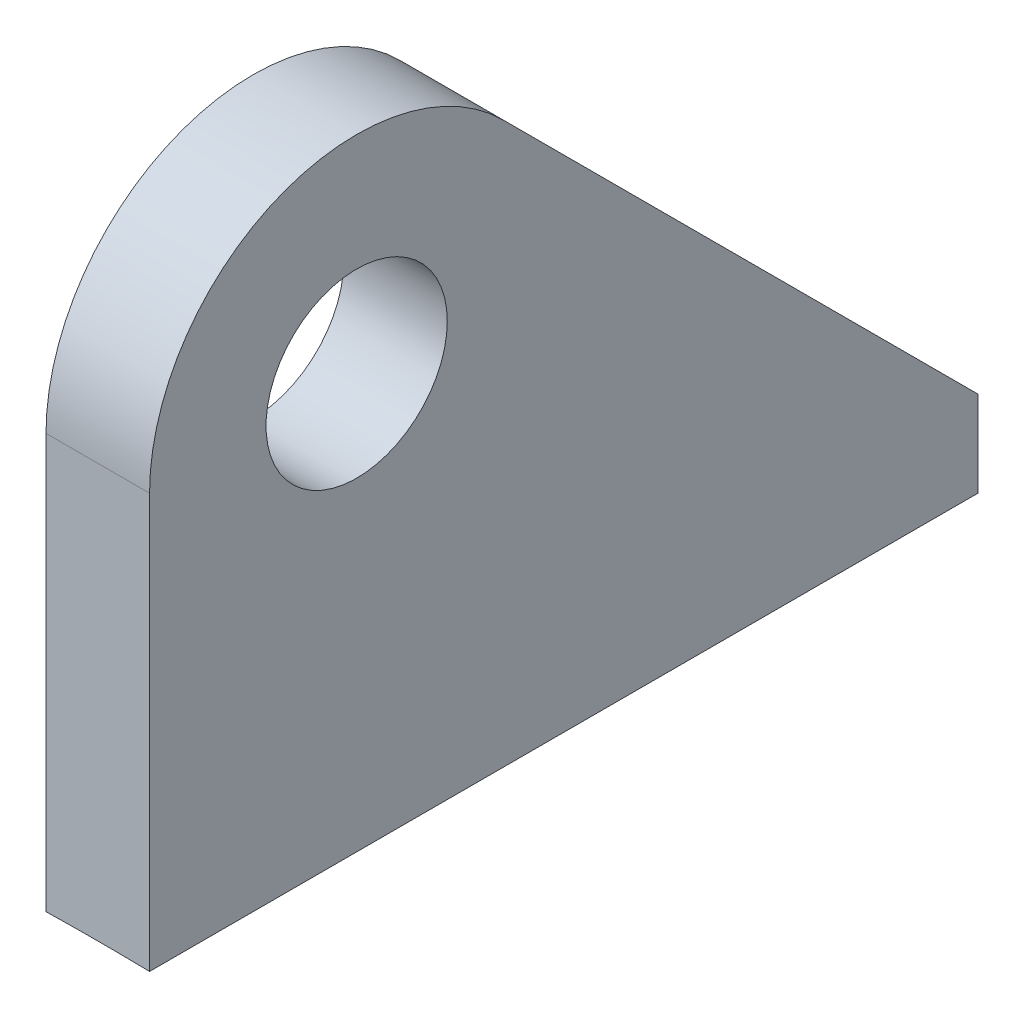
ISO-10303-21;
HEADER;
FILE_DESCRIPTION(('STEP AP214'),'2;1');
FILE_NAME('part.step','',(''),(''),'','','');
FILE_SCHEMA(('AUTOMOTIVE_DESIGN { 1 0 10303 214 1 1 1 1 }'));
ENDSEC;
DATA;
#1=APPLICATION_CONTEXT('core data for automotive mechanical design processes');
#2=APPLICATION_PROTOCOL_DEFINITION('international standard','automotive_design',2000,#1);
#3=PRODUCT_CONTEXT('',#1,'mechanical');
#4=PRODUCT('Part','Part','',(#3));
#5=PRODUCT_RELATED_PRODUCT_CATEGORY('part','',(#4));
#6=PRODUCT_DEFINITION_FORMATION('','',#4);
#7=PRODUCT_DEFINITION_CONTEXT('part definition',#1,'design');
#8=PRODUCT_DEFINITION('design','',#6,#7);
#9=PRODUCT_DEFINITION_SHAPE('','',#8);
#10=(LENGTH_UNIT() NAMED_UNIT(*) SI_UNIT(.MILLI.,.METRE.));
#11=(NAMED_UNIT(*) PLANE_ANGLE_UNIT() SI_UNIT($,.RADIAN.));
#12=(NAMED_UNIT(*) SI_UNIT($,.STERADIAN.) SOLID_ANGLE_UNIT());
#13=UNCERTAINTY_MEASURE_WITH_UNIT(LENGTH_MEASURE(1.E-05),#10,'distance_accuracy_value','');
#14=(GEOMETRIC_REPRESENTATION_CONTEXT(3) GLOBAL_UNCERTAINTY_ASSIGNED_CONTEXT((#13)) GLOBAL_UNIT_ASSIGNED_CONTEXT((#10,
#11,#12)) REPRESENTATION_CONTEXT('',''));
#15=CARTESIAN_POINT('',(0.,0.,0.));
#16=DIRECTION('',(0.,0.,1.));
#17=DIRECTION('',(1.,0.,0.));
#18=AXIS2_PLACEMENT_3D('',#15,#16,#17);
#19=CARTESIAN_POINT('',(12.7,101.6,-50.8));
#20=DIRECTION('',(-1.,0.,0.));
#21=DIRECTION('',(0.,0.,1.));
#22=AXIS2_PLACEMENT_3D('',#19,#20,#21);
#23=PLANE('',#22);
#24=CARTESIAN_POINT('',(12.7,101.6,-50.8));
#25=DIRECTION('',(1.,0.,0.));
#26=DIRECTION('',(0.,0.,1.));
#27=AXIS2_PLACEMENT_3D('',#24,#25,#26);
#28=CIRCLE('',#27,50.8);
#29=CARTESIAN_POINT('',(12.7,137.521024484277,-86.7210244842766));
#30=VERTEX_POINT('',#29);
#31=CARTESIAN_POINT('',(12.7,101.6,0.));
#32=VERTEX_POINT('',#31);
#33=EDGE_CURVE('E118',#30,#32,#28,.T.);
#34=ORIENTED_EDGE('',*,*,#33,.T.);
#35=DIRECTION('',(0.,-1.,0.));
#36=VECTOR('',#35,1.);
#37=CARTESIAN_POINT('',(12.7,101.6,0.));
#38=LINE('',#37,#36);
#39=CARTESIAN_POINT('',(12.7000000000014,0.,0.));
#40=VERTEX_POINT('',#39);
#41=EDGE_CURVE('E79',#32,#40,#38,.T.);
#42=ORIENTED_EDGE('',*,*,#41,.T.);
#43=DIRECTION('',(0.,0.,-1.));
#44=VECTOR('',#43,1.);
#45=CARTESIAN_POINT('',(12.7,0.,0.));
#46=LINE('',#45,#44);
#47=CARTESIAN_POINT('',(12.7000000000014,0.,-203.2));
#48=VERTEX_POINT('',#47);
#49=EDGE_CURVE('E92',#40,#48,#46,.T.);
#50=ORIENTED_EDGE('',*,*,#49,.T.);
#51=DIRECTION('',(0.,1.,0.));
#52=VECTOR('',#51,1.);
#53=CARTESIAN_POINT('',(12.7,0.,-203.2));
#54=LINE('',#53,#52);
#55=CARTESIAN_POINT('',(12.7,21.0420489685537,-203.2));
#56=VERTEX_POINT('',#55);
#57=EDGE_CURVE('E100',#48,#56,#54,.T.);
#58=ORIENTED_EDGE('',*,*,#57,.T.);
#59=DIRECTION('',(0.,0.707106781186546,0.707106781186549));
#60=VECTOR('',#59,1.);
#61=CARTESIAN_POINT('',(12.7,21.0420489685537,-203.2));
#62=LINE('',#61,#60);
#63=EDGE_CURVE('E50',#56,#30,#62,.T.);
#64=ORIENTED_EDGE('',*,*,#63,.T.);
#65=EDGE_LOOP('',(#34,#42,#50,#58,#64));
#66=FACE_BOUND('',#65,.T.);
#67=CARTESIAN_POINT('',(12.7,101.6,-50.8));
#68=DIRECTION('',(1.,0.,0.));
#69=DIRECTION('',(0.,0.,-1.));
#70=AXIS2_PLACEMENT_3D('',#67,#68,#69);
#71=CIRCLE('',#70,22.225);
#72=CARTESIAN_POINT('',(12.7,101.6,-73.025));
#73=VERTEX_POINT('',#72);
#74=EDGE_CURVE('E112',#73,#73,#71,.T.);
#75=ORIENTED_EDGE('',*,*,#74,.F.);
#76=EDGE_LOOP('',(#75));
#77=FACE_BOUND('',#76,.T.);
#78=ADVANCED_FACE('F33',(#66,#77),#23,.F.);
#79=CARTESIAN_POINT('',(-12.7,101.6,-50.8));
#80=DIRECTION('',(-1.,0.,0.));
#81=DIRECTION('',(0.,0.,1.));
#82=AXIS2_PLACEMENT_3D('',#79,#80,#81);
#83=PLANE('',#82);
#84=CARTESIAN_POINT('',(-12.7,101.6,-50.8));
#85=DIRECTION('',(1.,0.,0.));
#86=DIRECTION('',(0.,0.,1.));
#87=AXIS2_PLACEMENT_3D('',#84,#85,#86);
#88=CIRCLE('',#87,50.8);
#89=CARTESIAN_POINT('',(-12.7,137.521024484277,-86.7210244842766));
#90=VERTEX_POINT('',#89);
#91=CARTESIAN_POINT('',(-12.7,101.6,0.));
#92=VERTEX_POINT('',#91);
#93=EDGE_CURVE('E108',#90,#92,#88,.T.);
#94=ORIENTED_EDGE('',*,*,#93,.F.);
#95=DIRECTION('',(0.,0.707106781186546,0.707106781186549));
#96=VECTOR('',#95,1.);
#97=CARTESIAN_POINT('',(-12.7,21.0420489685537,-203.2));
#98=LINE('',#97,#96);
#99=CARTESIAN_POINT('',(-12.7,21.0420489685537,-203.2));
#100=VERTEX_POINT('',#99);
#101=EDGE_CURVE('E73',#100,#90,#98,.T.);
#102=ORIENTED_EDGE('',*,*,#101,.F.);
#103=DIRECTION('',(0.,1.,0.));
#104=VECTOR('',#103,1.);
#105=CARTESIAN_POINT('',(-12.7,0.,-203.2));
#106=LINE('',#105,#104);
#107=CARTESIAN_POINT('',(-12.7,0.,-203.2));
#108=VERTEX_POINT('',#107);
#109=EDGE_CURVE('E68',#108,#100,#106,.T.);
#110=ORIENTED_EDGE('',*,*,#109,.F.);
#111=DIRECTION('',(0.,0.,-1.));
#112=VECTOR('',#111,1.);
#113=CARTESIAN_POINT('',(-12.7,0.,0.));
#114=LINE('',#113,#112);
#115=CARTESIAN_POINT('',(-12.7000000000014,0.,0.));
#116=VERTEX_POINT('',#115);
#117=EDGE_CURVE('E94',#116,#108,#114,.T.);
#118=ORIENTED_EDGE('',*,*,#117,.F.);
#119=DIRECTION('',(0.,-1.,0.));
#120=VECTOR('',#119,1.);
#121=CARTESIAN_POINT('',(-12.7,101.6,0.));
#122=LINE('',#121,#120);
#123=EDGE_CURVE('E111',#92,#116,#122,.T.);
#124=ORIENTED_EDGE('',*,*,#123,.F.);
#125=EDGE_LOOP('',(#94,#102,#110,#118,#124));
#126=FACE_BOUND('',#125,.T.);
#127=CARTESIAN_POINT('',(-12.7,101.6,-50.8));
#128=DIRECTION('',(1.,0.,0.));
#129=DIRECTION('',(0.,0.,-1.));
#130=AXIS2_PLACEMENT_3D('',#127,#128,#129);
#131=CIRCLE('',#130,22.225);
#132=CARTESIAN_POINT('',(-12.7,101.6,-73.025));
#133=VERTEX_POINT('',#132);
#134=EDGE_CURVE('E96',#133,#133,#131,.T.);
#135=ORIENTED_EDGE('',*,*,#134,.T.);
#136=EDGE_LOOP('',(#135));
#137=FACE_BOUND('',#136,.T.);
#138=ADVANCED_FACE('F122',(#126,#137),#83,.T.);
#139=CARTESIAN_POINT('',(12.7,101.6,-50.8));
#140=DIRECTION('',(-1.,0.,0.));
#141=DIRECTION('',(0.,0.,1.));
#142=AXIS2_PLACEMENT_3D('',#139,#140,#141);
#143=CYLINDRICAL_SURFACE('',#142,50.8);
#144=ORIENTED_EDGE('',*,*,#93,.T.);
#145=DIRECTION('',(-1.,0.,0.));
#146=VECTOR('',#145,1.);
#147=CARTESIAN_POINT('',(12.7,101.6,0.));
#148=LINE('',#147,#146);
#149=EDGE_CURVE('E11',#32,#92,#148,.T.);
#150=ORIENTED_EDGE('',*,*,#149,.F.);
#151=ORIENTED_EDGE('',*,*,#33,.F.);
#152=DIRECTION('',(-1.,0.,0.));
#153=VECTOR('',#152,1.);
#154=CARTESIAN_POINT('',(12.7,137.521024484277,-86.7210244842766));
#155=LINE('',#154,#153);
#156=EDGE_CURVE('E104',#30,#90,#155,.T.);
#157=ORIENTED_EDGE('',*,*,#156,.T.);
#158=EDGE_LOOP('',(#144,#150,#151,#157));
#159=FACE_BOUND('',#158,.T.);
#160=ADVANCED_FACE('F35',(#159),#143,.T.);
#161=CARTESIAN_POINT('',(12.7,101.6,0.));
#162=DIRECTION('',(0.,0.,-1.));
#163=DIRECTION('',(-1.,0.,0.));
#164=AXIS2_PLACEMENT_3D('',#161,#162,#163);
#165=PLANE('',#164);
#166=ORIENTED_EDGE('',*,*,#123,.T.);
#167=CARTESIAN_POINT('',(0.,-609.467693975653,0.));
#168=DIRECTION('',(0.,0.,1.));
#169=DIRECTION('',(1.,0.,0.));
#170=AXIS2_PLACEMENT_3D('',#167,#168,#169);
#171=CIRCLE('',#170,609.6);
#172=EDGE_CURVE('E97',#40,#116,#171,.T.);
#173=ORIENTED_EDGE('',*,*,#172,.F.);
#174=ORIENTED_EDGE('',*,*,#41,.F.);
#175=ORIENTED_EDGE('',*,*,#149,.T.);
#176=EDGE_LOOP('',(#166,#173,#174,#175));
#177=FACE_BOUND('',#176,.T.);
#178=ADVANCED_FACE('F133',(#177),#165,.F.);
#179=CARTESIAN_POINT('',(12.7,0.,-203.2));
#180=DIRECTION('',(0.,0.,1.));
#181=DIRECTION('',(0.,-1.,0.));
#182=AXIS2_PLACEMENT_3D('',#179,#180,#181);
#183=PLANE('',#182);
#184=ORIENTED_EDGE('',*,*,#57,.F.);
#185=CARTESIAN_POINT('',(0.,-609.467693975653,-203.2));
#186=DIRECTION('',(0.,0.,1.));
#187=DIRECTION('',(1.,0.,0.));
#188=AXIS2_PLACEMENT_3D('',#185,#186,#187);
#189=CIRCLE('',#188,609.6);
#190=EDGE_CURVE('E89',#48,#108,#189,.T.);
#191=ORIENTED_EDGE('',*,*,#190,.T.);
#192=ORIENTED_EDGE('',*,*,#109,.T.);
#193=DIRECTION('',(-1.,0.,0.));
#194=VECTOR('',#193,1.);
#195=CARTESIAN_POINT('',(12.7,21.0420489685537,-203.2));
#196=LINE('',#195,#194);
#197=EDGE_CURVE('E42',#56,#100,#196,.T.);
#198=ORIENTED_EDGE('',*,*,#197,.F.);
#199=EDGE_LOOP('',(#184,#191,#192,#198));
#200=FACE_BOUND('',#199,.T.);
#201=ADVANCED_FACE('F102',(#200),#183,.F.);
#202=CARTESIAN_POINT('',(12.7,21.0420489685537,-203.2));
#203=DIRECTION('',(0.,-0.707106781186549,0.707106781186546));
#204=DIRECTION('',(0.,-0.707106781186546,-0.707106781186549));
#205=AXIS2_PLACEMENT_3D('',#202,#203,#204);
#206=PLANE('',#205);
#207=ORIENTED_EDGE('',*,*,#101,.T.);
#208=ORIENTED_EDGE('',*,*,#156,.F.);
#209=ORIENTED_EDGE('',*,*,#63,.F.);
#210=ORIENTED_EDGE('',*,*,#197,.T.);
#211=EDGE_LOOP('',(#207,#208,#209,#210));
#212=FACE_BOUND('',#211,.T.);
#213=ADVANCED_FACE('F119',(#212),#206,.F.);
#214=CARTESIAN_POINT('',(12.7,101.6,-50.8));
#215=DIRECTION('',(-1.,0.,0.));
#216=DIRECTION('',(0.,0.,1.));
#217=AXIS2_PLACEMENT_3D('',#214,#215,#216);
#218=CYLINDRICAL_SURFACE('',#217,22.225);
#219=ORIENTED_EDGE('',*,*,#74,.T.);
#220=EDGE_LOOP('',(#219));
#221=FACE_BOUND('',#220,.T.);
#222=ORIENTED_EDGE('',*,*,#134,.F.);
#223=EDGE_LOOP('',(#222));
#224=FACE_BOUND('',#223,.T.);
#225=ADVANCED_FACE('F147',(#221,#224),#218,.F.);
#226=CARTESIAN_POINT('',(0.,-609.467693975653,-203.2));
#227=DIRECTION('',(0.,0.,1.));
#228=DIRECTION('',(1.,0.,0.));
#229=AXIS2_PLACEMENT_3D('',#226,#227,#228);
#230=CYLINDRICAL_SURFACE('',#229,609.6);
#231=ORIENTED_EDGE('',*,*,#190,.F.);
#232=ORIENTED_EDGE('',*,*,#49,.F.);
#233=ORIENTED_EDGE('',*,*,#172,.T.);
#234=ORIENTED_EDGE('',*,*,#117,.T.);
#235=EDGE_LOOP('',(#231,#232,#233,#234));
#236=FACE_BOUND('',#235,.T.);
#237=ADVANCED_FACE('F91',(#236),#230,.F.);
#238=CLOSED_SHELL('',(#78,#138,#160,#178,#201,#213,#225,#237));
#239=MANIFOLD_SOLID_BREP('B2',#238);
#240=ADVANCED_BREP_SHAPE_REPRESENTATION('',(#18,#239),#14);
#241=SHAPE_DEFINITION_REPRESENTATION(#9,#240);
ENDSEC;
END-ISO-10303-21;
